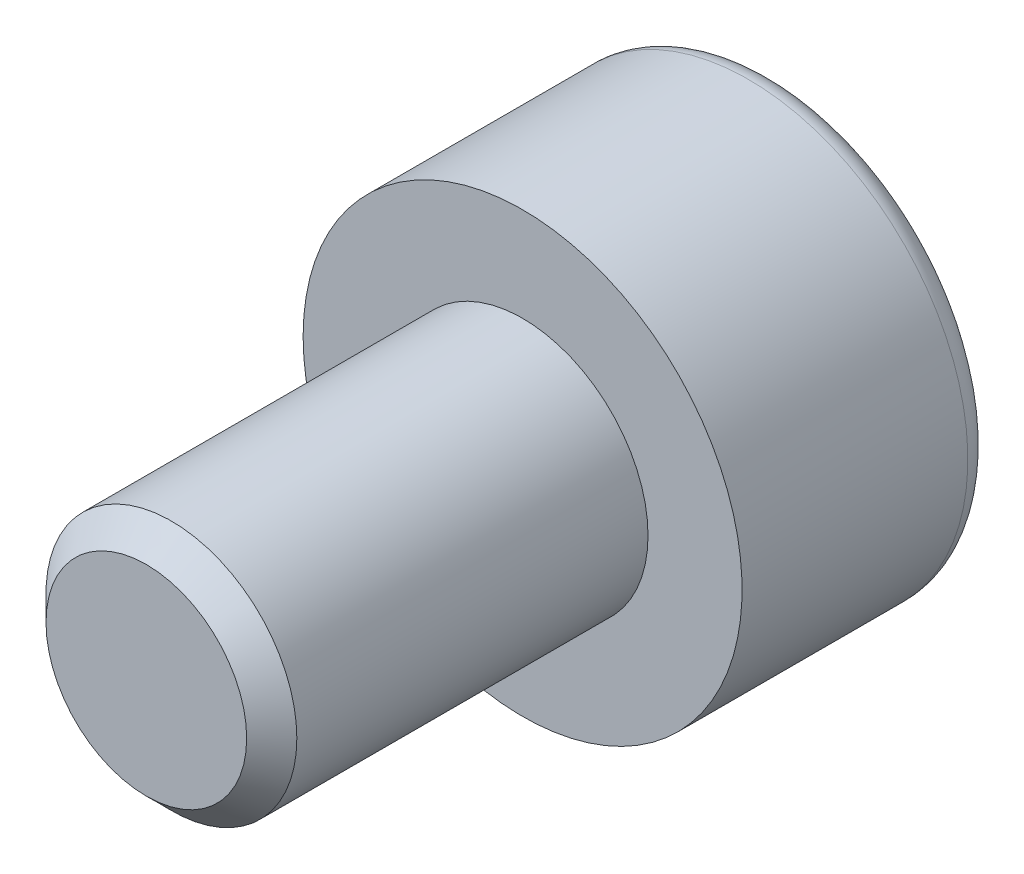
ISO-10303-21;
HEADER;
FILE_DESCRIPTION(('STEP AP214'),'2;1');
FILE_NAME('part.step','',(''),(''),'','','');
FILE_SCHEMA(('AUTOMOTIVE_DESIGN { 1 0 10303 214 1 1 1 1 }'));
ENDSEC;
DATA;
#1=APPLICATION_CONTEXT('core data for automotive mechanical design processes');
#2=APPLICATION_PROTOCOL_DEFINITION('international standard','automotive_design',2000,#1);
#3=PRODUCT_CONTEXT('',#1,'mechanical');
#4=PRODUCT('Part','Part','',(#3));
#5=PRODUCT_RELATED_PRODUCT_CATEGORY('part','',(#4));
#6=PRODUCT_DEFINITION_FORMATION('','',#4);
#7=PRODUCT_DEFINITION_CONTEXT('part definition',#1,'design');
#8=PRODUCT_DEFINITION('design','',#6,#7);
#9=PRODUCT_DEFINITION_SHAPE('','',#8);
#10=(LENGTH_UNIT() NAMED_UNIT(*) SI_UNIT(.MILLI.,.METRE.));
#11=(NAMED_UNIT(*) PLANE_ANGLE_UNIT() SI_UNIT($,.RADIAN.));
#12=(NAMED_UNIT(*) SI_UNIT($,.STERADIAN.) SOLID_ANGLE_UNIT());
#13=UNCERTAINTY_MEASURE_WITH_UNIT(LENGTH_MEASURE(1.E-05),#10,'distance_accuracy_value','');
#14=(GEOMETRIC_REPRESENTATION_CONTEXT(3) GLOBAL_UNCERTAINTY_ASSIGNED_CONTEXT((#13)) GLOBAL_UNIT_ASSIGNED_CONTEXT((#10,
#11,#12)) REPRESENTATION_CONTEXT('',''));
#15=CARTESIAN_POINT('',(0.,0.,0.));
#16=DIRECTION('',(0.,0.,1.));
#17=DIRECTION('',(1.,0.,0.));
#18=AXIS2_PLACEMENT_3D('',#15,#16,#17);
#19=CARTESIAN_POINT('',(0.,0.,-4.));
#20=DIRECTION('',(0.,0.,1.));
#21=DIRECTION('',(1.,0.,0.));
#22=AXIS2_PLACEMENT_3D('',#19,#20,#21);
#23=PLANE('',#22);
#24=CARTESIAN_POINT('',(0.,0.,-4.));
#25=DIRECTION('',(0.,0.,-1.));
#26=DIRECTION('',(-1.,0.,0.));
#27=AXIS2_PLACEMENT_3D('',#24,#25,#26);
#28=CIRCLE('',#27,3.1);
#29=CARTESIAN_POINT('',(-3.1,0.,-4.));
#30=VERTEX_POINT('',#29);
#31=EDGE_CURVE('E141',#30,#30,#28,.T.);
#32=ORIENTED_EDGE('',*,*,#31,.T.);
#33=EDGE_LOOP('',(#32));
#34=FACE_BOUND('',#33,.T.);
#35=DIRECTION('',(-0.86602540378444,0.499999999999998,0.));
#36=VECTOR('',#35,1.);
#37=CARTESIAN_POINT('',(0.,1.73205080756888,-4.));
#38=LINE('',#37,#36);
#39=CARTESIAN_POINT('',(1.5,0.866025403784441,-4.));
#40=VERTEX_POINT('',#39);
#41=CARTESIAN_POINT('',(0.,1.73205080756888,-4.));
#42=VERTEX_POINT('',#41);
#43=EDGE_CURVE('E45',#40,#42,#38,.T.);
#44=ORIENTED_EDGE('',*,*,#43,.T.);
#45=DIRECTION('',(-0.866025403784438,-0.500000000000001,0.));
#46=VECTOR('',#45,1.);
#47=CARTESIAN_POINT('',(0.,1.73205080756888,-4.));
#48=LINE('',#47,#46);
#49=CARTESIAN_POINT('',(-1.5,0.866025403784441,-4.));
#50=VERTEX_POINT('',#49);
#51=EDGE_CURVE('E85',#42,#50,#48,.T.);
#52=ORIENTED_EDGE('',*,*,#51,.T.);
#53=DIRECTION('',(0.,-1.,0.));
#54=VECTOR('',#53,1.);
#55=CARTESIAN_POINT('',(-1.5,-0.866025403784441,-4.));
#56=LINE('',#55,#54);
#57=CARTESIAN_POINT('',(-1.5,-0.866025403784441,-4.));
#58=VERTEX_POINT('',#57);
#59=EDGE_CURVE('E93',#50,#58,#56,.T.);
#60=ORIENTED_EDGE('',*,*,#59,.T.);
#61=DIRECTION('',(0.866025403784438,-0.500000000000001,0.));
#62=VECTOR('',#61,1.);
#63=CARTESIAN_POINT('',(0.,-1.73205080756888,-4.));
#64=LINE('',#63,#62);
#65=CARTESIAN_POINT('',(0.,-1.73205080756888,-4.));
#66=VERTEX_POINT('',#65);
#67=EDGE_CURVE('E111',#58,#66,#64,.T.);
#68=ORIENTED_EDGE('',*,*,#67,.T.);
#69=DIRECTION('',(0.86602540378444,0.499999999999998,0.));
#70=VECTOR('',#69,1.);
#71=CARTESIAN_POINT('',(0.,-1.73205080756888,-4.));
#72=LINE('',#71,#70);
#73=CARTESIAN_POINT('',(1.5,-0.866025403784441,-4.));
#74=VERTEX_POINT('',#73);
#75=EDGE_CURVE('E114',#66,#74,#72,.T.);
#76=ORIENTED_EDGE('',*,*,#75,.T.);
#77=DIRECTION('',(0.,1.,0.));
#78=VECTOR('',#77,1.);
#79=CARTESIAN_POINT('',(1.5,-0.866025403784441,-4.));
#80=LINE('',#79,#78);
#81=EDGE_CURVE('E104',#74,#40,#80,.T.);
#82=ORIENTED_EDGE('',*,*,#81,.T.);
#83=EDGE_LOOP('',(#44,#52,#60,#68,#76,#82));
#84=FACE_BOUND('',#83,.T.);
#85=ADVANCED_FACE('F31',(#34,#84),#23,.F.);
#86=CARTESIAN_POINT('',(0.,0.,-3.6));
#87=DIRECTION('',(0.,0.,-1.));
#88=DIRECTION('',(-1.,0.,0.));
#89=AXIS2_PLACEMENT_3D('',#86,#87,#88);
#90=TOROIDAL_SURFACE('',#89,3.1,0.4);
#91=ORIENTED_EDGE('',*,*,#31,.F.);
#92=EDGE_LOOP('',(#91));
#93=FACE_BOUND('',#92,.T.);
#94=CARTESIAN_POINT('',(0.,0.,-3.6));
#95=DIRECTION('',(0.,0.,-1.));
#96=DIRECTION('',(-1.,0.,0.));
#97=AXIS2_PLACEMENT_3D('',#94,#95,#96);
#98=CIRCLE('',#97,3.5);
#99=CARTESIAN_POINT('',(-3.5,0.,-3.6));
#100=VERTEX_POINT('',#99);
#101=EDGE_CURVE('E138',#100,#100,#98,.T.);
#102=ORIENTED_EDGE('',*,*,#101,.T.);
#103=EDGE_LOOP('',(#102));
#104=FACE_BOUND('',#103,.T.);
#105=ADVANCED_FACE('F160',(#93,#104),#90,.T.);
#106=CARTESIAN_POINT('',(0.,0.,0.));
#107=DIRECTION('',(0.,0.,-1.));
#108=DIRECTION('',(-1.,0.,0.));
#109=AXIS2_PLACEMENT_3D('',#106,#107,#108);
#110=CYLINDRICAL_SURFACE('',#109,3.5);
#111=ORIENTED_EDGE('',*,*,#101,.F.);
#112=EDGE_LOOP('',(#111));
#113=FACE_BOUND('',#112,.T.);
#114=CARTESIAN_POINT('',(0.,0.,0.));
#115=DIRECTION('',(0.,0.,-1.));
#116=DIRECTION('',(-1.,0.,0.));
#117=AXIS2_PLACEMENT_3D('',#114,#115,#116);
#118=CIRCLE('',#117,3.5);
#119=CARTESIAN_POINT('',(-3.5,0.,0.));
#120=VERTEX_POINT('',#119);
#121=EDGE_CURVE('E99',#120,#120,#118,.T.);
#122=ORIENTED_EDGE('',*,*,#121,.T.);
#123=EDGE_LOOP('',(#122));
#124=FACE_BOUND('',#123,.T.);
#125=ADVANCED_FACE('F165',(#113,#124),#110,.T.);
#126=CARTESIAN_POINT('',(0.,0.,0.));
#127=DIRECTION('',(0.,0.,-1.));
#128=DIRECTION('',(-1.,0.,0.));
#129=AXIS2_PLACEMENT_3D('',#126,#127,#128);
#130=PLANE('',#129);
#131=CARTESIAN_POINT('',(0.,0.,0.));
#132=DIRECTION('',(0.,0.,1.));
#133=DIRECTION('',(1.,0.,0.));
#134=AXIS2_PLACEMENT_3D('',#131,#132,#133);
#135=CIRCLE('',#134,2.);
#136=CARTESIAN_POINT('',(2.,0.,0.));
#137=VERTEX_POINT('',#136);
#138=EDGE_CURVE('E105',#137,#137,#135,.T.);
#139=ORIENTED_EDGE('',*,*,#138,.F.);
#140=EDGE_LOOP('',(#139));
#141=FACE_BOUND('',#140,.T.);
#142=ORIENTED_EDGE('',*,*,#121,.F.);
#143=EDGE_LOOP('',(#142));
#144=FACE_BOUND('',#143,.T.);
#145=ADVANCED_FACE('F173',(#141,#144),#130,.F.);
#146=CARTESIAN_POINT('',(0.,1.73205080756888,-2.));
#147=DIRECTION('',(-0.499999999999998,-0.86602540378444,0.));
#148=DIRECTION('',(0.86602540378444,-0.499999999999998,0.));
#149=AXIS2_PLACEMENT_3D('',#146,#147,#148);
#150=PLANE('',#149);
#151=ORIENTED_EDGE('',*,*,#43,.F.);
#152=DIRECTION('',(0.,0.,-1.));
#153=VECTOR('',#152,1.);
#154=CARTESIAN_POINT('',(1.5,0.866025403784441,-2.));
#155=LINE('',#154,#153);
#156=CARTESIAN_POINT('',(1.5,0.866025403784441,-2.));
#157=VERTEX_POINT('',#156);
#158=EDGE_CURVE('E127',#157,#40,#155,.T.);
#159=ORIENTED_EDGE('',*,*,#158,.F.);
#160=DIRECTION('',(-0.86602540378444,0.499999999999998,0.));
#161=VECTOR('',#160,1.);
#162=CARTESIAN_POINT('',(0.,1.73205080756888,-2.));
#163=LINE('',#162,#161);
#164=CARTESIAN_POINT('',(0.,1.73205080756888,-2.));
#165=VERTEX_POINT('',#164);
#166=EDGE_CURVE('E98',#157,#165,#163,.T.);
#167=ORIENTED_EDGE('',*,*,#166,.T.);
#168=DIRECTION('',(0.,0.,-1.));
#169=VECTOR('',#168,1.);
#170=CARTESIAN_POINT('',(0.,1.73205080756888,-2.));
#171=LINE('',#170,#169);
#172=EDGE_CURVE('E87',#165,#42,#171,.T.);
#173=ORIENTED_EDGE('',*,*,#172,.T.);
#174=EDGE_LOOP('',(#151,#159,#167,#173));
#175=FACE_BOUND('',#174,.T.);
#176=ADVANCED_FACE('F96',(#175),#150,.T.);
#177=CARTESIAN_POINT('',(0.,1.73205080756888,-2.));
#178=DIRECTION('',(0.500000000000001,-0.866025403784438,0.));
#179=DIRECTION('',(0.866025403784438,0.500000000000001,0.));
#180=AXIS2_PLACEMENT_3D('',#177,#178,#179);
#181=PLANE('',#180);
#182=ORIENTED_EDGE('',*,*,#51,.F.);
#183=ORIENTED_EDGE('',*,*,#172,.F.);
#184=DIRECTION('',(-0.866025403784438,-0.500000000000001,0.));
#185=VECTOR('',#184,1.);
#186=CARTESIAN_POINT('',(0.,1.73205080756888,-2.));
#187=LINE('',#186,#185);
#188=CARTESIAN_POINT('',(-1.5,0.866025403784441,-2.));
#189=VERTEX_POINT('',#188);
#190=EDGE_CURVE('E118',#165,#189,#187,.T.);
#191=ORIENTED_EDGE('',*,*,#190,.T.);
#192=DIRECTION('',(0.,0.,-1.));
#193=VECTOR('',#192,1.);
#194=CARTESIAN_POINT('',(-1.5,0.866025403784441,-2.));
#195=LINE('',#194,#193);
#196=EDGE_CURVE('E89',#189,#50,#195,.T.);
#197=ORIENTED_EDGE('',*,*,#196,.T.);
#198=EDGE_LOOP('',(#182,#183,#191,#197));
#199=FACE_BOUND('',#198,.T.);
#200=ADVANCED_FACE('F86',(#199),#181,.T.);
#201=CARTESIAN_POINT('',(-1.5,-0.866025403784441,-2.));
#202=DIRECTION('',(1.,0.,0.));
#203=DIRECTION('',(0.,0.,-1.));
#204=AXIS2_PLACEMENT_3D('',#201,#202,#203);
#205=PLANE('',#204);
#206=ORIENTED_EDGE('',*,*,#59,.F.);
#207=ORIENTED_EDGE('',*,*,#196,.F.);
#208=DIRECTION('',(0.,-1.,0.));
#209=VECTOR('',#208,1.);
#210=CARTESIAN_POINT('',(-1.5,-0.866025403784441,-2.));
#211=LINE('',#210,#209);
#212=CARTESIAN_POINT('',(-1.5,-0.866025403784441,-2.));
#213=VERTEX_POINT('',#212);
#214=EDGE_CURVE('E120',#189,#213,#211,.T.);
#215=ORIENTED_EDGE('',*,*,#214,.T.);
#216=DIRECTION('',(0.,0.,-1.));
#217=VECTOR('',#216,1.);
#218=CARTESIAN_POINT('',(-1.5,-0.866025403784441,-2.));
#219=LINE('',#218,#217);
#220=EDGE_CURVE('E133',#213,#58,#219,.T.);
#221=ORIENTED_EDGE('',*,*,#220,.T.);
#222=EDGE_LOOP('',(#206,#207,#215,#221));
#223=FACE_BOUND('',#222,.T.);
#224=ADVANCED_FACE('F188',(#223),#205,.T.);
#225=CARTESIAN_POINT('',(0.,-1.73205080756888,-2.));
#226=DIRECTION('',(0.500000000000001,0.866025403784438,0.));
#227=DIRECTION('',(-0.866025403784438,0.500000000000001,0.));
#228=AXIS2_PLACEMENT_3D('',#225,#226,#227);
#229=PLANE('',#228);
#230=ORIENTED_EDGE('',*,*,#67,.F.);
#231=ORIENTED_EDGE('',*,*,#220,.F.);
#232=DIRECTION('',(0.866025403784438,-0.500000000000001,0.));
#233=VECTOR('',#232,1.);
#234=CARTESIAN_POINT('',(0.,-1.73205080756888,-2.));
#235=LINE('',#234,#233);
#236=CARTESIAN_POINT('',(0.,-1.73205080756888,-2.));
#237=VERTEX_POINT('',#236);
#238=EDGE_CURVE('E122',#213,#237,#235,.T.);
#239=ORIENTED_EDGE('',*,*,#238,.T.);
#240=DIRECTION('',(0.,0.,-1.));
#241=VECTOR('',#240,1.);
#242=CARTESIAN_POINT('',(0.,-1.73205080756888,-2.));
#243=LINE('',#242,#241);
#244=EDGE_CURVE('E131',#237,#66,#243,.T.);
#245=ORIENTED_EDGE('',*,*,#244,.T.);
#246=EDGE_LOOP('',(#230,#231,#239,#245));
#247=FACE_BOUND('',#246,.T.);
#248=ADVANCED_FACE('F191',(#247),#229,.T.);
#249=CARTESIAN_POINT('',(0.,-1.73205080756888,-2.));
#250=DIRECTION('',(-0.499999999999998,0.86602540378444,0.));
#251=DIRECTION('',(-0.86602540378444,-0.499999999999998,0.));
#252=AXIS2_PLACEMENT_3D('',#249,#250,#251);
#253=PLANE('',#252);
#254=ORIENTED_EDGE('',*,*,#75,.F.);
#255=ORIENTED_EDGE('',*,*,#244,.F.);
#256=DIRECTION('',(0.86602540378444,0.499999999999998,0.));
#257=VECTOR('',#256,1.);
#258=CARTESIAN_POINT('',(0.,-1.73205080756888,-2.));
#259=LINE('',#258,#257);
#260=CARTESIAN_POINT('',(1.5,-0.866025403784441,-2.));
#261=VERTEX_POINT('',#260);
#262=EDGE_CURVE('E124',#237,#261,#259,.T.);
#263=ORIENTED_EDGE('',*,*,#262,.T.);
#264=DIRECTION('',(0.,0.,-1.));
#265=VECTOR('',#264,1.);
#266=CARTESIAN_POINT('',(1.5,-0.866025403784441,-2.));
#267=LINE('',#266,#265);
#268=EDGE_CURVE('E129',#261,#74,#267,.T.);
#269=ORIENTED_EDGE('',*,*,#268,.T.);
#270=EDGE_LOOP('',(#254,#255,#263,#269));
#271=FACE_BOUND('',#270,.T.);
#272=ADVANCED_FACE('F195',(#271),#253,.T.);
#273=CARTESIAN_POINT('',(1.5,-0.866025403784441,-2.));
#274=DIRECTION('',(-1.,0.,0.));
#275=DIRECTION('',(0.,0.,1.));
#276=AXIS2_PLACEMENT_3D('',#273,#274,#275);
#277=PLANE('',#276);
#278=ORIENTED_EDGE('',*,*,#81,.F.);
#279=ORIENTED_EDGE('',*,*,#268,.F.);
#280=DIRECTION('',(0.,1.,0.));
#281=VECTOR('',#280,1.);
#282=CARTESIAN_POINT('',(1.5,-0.866025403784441,-2.));
#283=LINE('',#282,#281);
#284=EDGE_CURVE('E52',#261,#157,#283,.T.);
#285=ORIENTED_EDGE('',*,*,#284,.T.);
#286=ORIENTED_EDGE('',*,*,#158,.T.);
#287=EDGE_LOOP('',(#278,#279,#285,#286));
#288=FACE_BOUND('',#287,.T.);
#289=ADVANCED_FACE('F199',(#288),#277,.T.);
#290=CARTESIAN_POINT('',(1.5,0.866025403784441,-2.));
#291=DIRECTION('',(0.,0.,1.));
#292=DIRECTION('',(1.,0.,0.));
#293=AXIS2_PLACEMENT_3D('',#290,#291,#292);
#294=PLANE('',#293);
#295=ORIENTED_EDGE('',*,*,#166,.F.);
#296=ORIENTED_EDGE('',*,*,#284,.F.);
#297=ORIENTED_EDGE('',*,*,#262,.F.);
#298=ORIENTED_EDGE('',*,*,#238,.F.);
#299=ORIENTED_EDGE('',*,*,#214,.F.);
#300=ORIENTED_EDGE('',*,*,#190,.F.);
#301=EDGE_LOOP('',(#295,#296,#297,#298,#299,#300));
#302=FACE_BOUND('',#301,.T.);
#303=ADVANCED_FACE('F203',(#302),#294,.F.);
#304=CARTESIAN_POINT('',(0.,0.,6.));
#305=DIRECTION('',(0.,0.,1.));
#306=DIRECTION('',(1.,0.,0.));
#307=AXIS2_PLACEMENT_3D('',#304,#305,#306);
#308=PLANE('',#307);
#309=CARTESIAN_POINT('',(0.,0.,6.));
#310=DIRECTION('',(0.,0.,1.));
#311=DIRECTION('',(1.,0.,0.));
#312=AXIS2_PLACEMENT_3D('',#309,#310,#311);
#313=CIRCLE('',#312,1.6);
#314=CARTESIAN_POINT('',(1.6,0.,6.));
#315=VERTEX_POINT('',#314);
#316=EDGE_CURVE('E38',#315,#315,#313,.T.);
#317=ORIENTED_EDGE('',*,*,#316,.T.);
#318=EDGE_LOOP('',(#317));
#319=FACE_BOUND('',#318,.T.);
#320=ADVANCED_FACE('F146',(#319),#308,.T.);
#321=CARTESIAN_POINT('',(0.,0.,0.));
#322=DIRECTION('',(0.,0.,1.));
#323=DIRECTION('',(1.,0.,0.));
#324=AXIS2_PLACEMENT_3D('',#321,#322,#323);
#325=CYLINDRICAL_SURFACE('',#324,2.);
#326=CARTESIAN_POINT('',(0.,0.,5.6));
#327=DIRECTION('',(0.,0.,1.));
#328=DIRECTION('',(1.,0.,0.));
#329=AXIS2_PLACEMENT_3D('',#326,#327,#328);
#330=CIRCLE('',#329,2.);
#331=CARTESIAN_POINT('',(2.,0.,5.6));
#332=VERTEX_POINT('',#331);
#333=EDGE_CURVE('E11',#332,#332,#330,.F.);
#334=ORIENTED_EDGE('',*,*,#333,.T.);
#335=EDGE_LOOP('',(#334));
#336=FACE_BOUND('',#335,.T.);
#337=ORIENTED_EDGE('',*,*,#138,.T.);
#338=EDGE_LOOP('',(#337));
#339=FACE_BOUND('',#338,.T.);
#340=ADVANCED_FACE('F150',(#336,#339),#325,.T.);
#341=CARTESIAN_POINT('',(0.,0.,6.));
#342=DIRECTION('',(0.,0.,-1.));
#343=DIRECTION('',(-1.,0.,0.));
#344=AXIS2_PLACEMENT_3D('',#341,#342,#343);
#345=CONICAL_SURFACE('',#344,1.6,0.785398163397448);
#346=ORIENTED_EDGE('',*,*,#333,.F.);
#347=EDGE_LOOP('',(#346));
#348=FACE_BOUND('',#347,.T.);
#349=ORIENTED_EDGE('',*,*,#316,.F.);
#350=EDGE_LOOP('',(#349));
#351=FACE_BOUND('',#350,.T.);
#352=ADVANCED_FACE('F148',(#348,#351),#345,.T.);
#353=CLOSED_SHELL('',(#85,#105,#125,#145,#176,#200,#224,#248,#272,#289,#303,#320,#340,#352));
#354=MANIFOLD_SOLID_BREP('B2',#353);
#355=ADVANCED_BREP_SHAPE_REPRESENTATION('',(#18,#354),#14);
#356=SHAPE_DEFINITION_REPRESENTATION(#9,#355);
ENDSEC;
END-ISO-10303-21;
